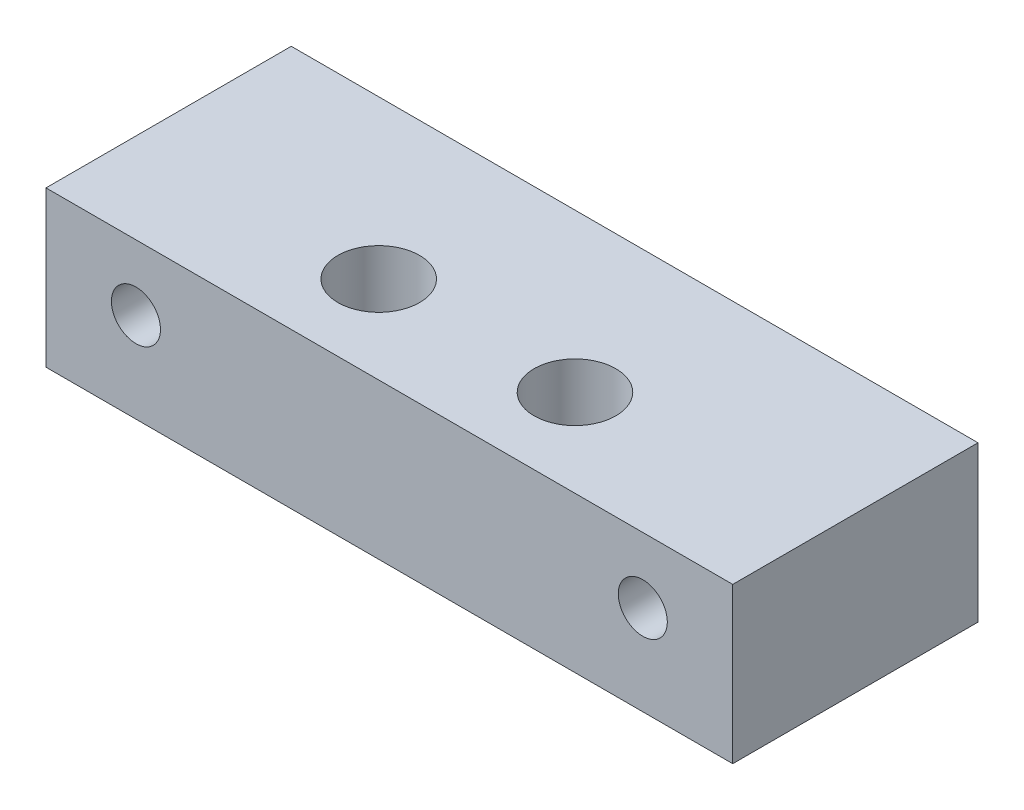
ISO-10303-21;
HEADER;
FILE_DESCRIPTION(('STEP AP214'),'2;1');
FILE_NAME('part.step','',(''),(''),'','','');
FILE_SCHEMA(('AUTOMOTIVE_DESIGN { 1 0 10303 214 1 1 1 1 }'));
ENDSEC;
DATA;
#1=APPLICATION_CONTEXT('core data for automotive mechanical design processes');
#2=APPLICATION_PROTOCOL_DEFINITION('international standard','automotive_design',2000,#1);
#3=PRODUCT_CONTEXT('',#1,'mechanical');
#4=PRODUCT('Part','Part','',(#3));
#5=PRODUCT_RELATED_PRODUCT_CATEGORY('part','',(#4));
#6=PRODUCT_DEFINITION_FORMATION('','',#4);
#7=PRODUCT_DEFINITION_CONTEXT('part definition',#1,'design');
#8=PRODUCT_DEFINITION('design','',#6,#7);
#9=PRODUCT_DEFINITION_SHAPE('','',#8);
#10=(LENGTH_UNIT() NAMED_UNIT(*) SI_UNIT(.MILLI.,.METRE.));
#11=(NAMED_UNIT(*) PLANE_ANGLE_UNIT() SI_UNIT($,.RADIAN.));
#12=(NAMED_UNIT(*) SI_UNIT($,.STERADIAN.) SOLID_ANGLE_UNIT());
#13=UNCERTAINTY_MEASURE_WITH_UNIT(LENGTH_MEASURE(1.E-05),#10,'distance_accuracy_value','');
#14=(GEOMETRIC_REPRESENTATION_CONTEXT(3) GLOBAL_UNCERTAINTY_ASSIGNED_CONTEXT((#13)) GLOBAL_UNIT_ASSIGNED_CONTEXT((#10,
#11,#12)) REPRESENTATION_CONTEXT('',''));
#15=CARTESIAN_POINT('',(0.,0.,0.));
#16=DIRECTION('',(0.,0.,1.));
#17=DIRECTION('',(1.,0.,0.));
#18=AXIS2_PLACEMENT_3D('',#15,#16,#17);
#19=CARTESIAN_POINT('',(-21.,9.5,7.49999999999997));
#20=DIRECTION('',(1.,0.,0.));
#21=DIRECTION('',(0.,0.,-1.));
#22=AXIS2_PLACEMENT_3D('',#19,#20,#21);
#23=PLANE('',#22);
#24=DIRECTION('',(0.,0.,1.));
#25=VECTOR('',#24,1.);
#26=CARTESIAN_POINT('',(-21.,0.,7.49999999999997));
#27=LINE('',#26,#25);
#28=CARTESIAN_POINT('',(-21.,0.,-7.50000000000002));
#29=VERTEX_POINT('',#28);
#30=CARTESIAN_POINT('',(-21.,0.,7.49999999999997));
#31=VERTEX_POINT('',#30);
#32=EDGE_CURVE('E97',#29,#31,#27,.T.);
#33=ORIENTED_EDGE('',*,*,#32,.T.);
#34=DIRECTION('',(0.,-1.,0.));
#35=VECTOR('',#34,1.);
#36=CARTESIAN_POINT('',(-21.,9.5,7.49999999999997));
#37=LINE('',#36,#35);
#38=CARTESIAN_POINT('',(-21.,9.5,7.49999999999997));
#39=VERTEX_POINT('',#38);
#40=EDGE_CURVE('E11',#39,#31,#37,.T.);
#41=ORIENTED_EDGE('',*,*,#40,.F.);
#42=DIRECTION('',(0.,0.,1.));
#43=VECTOR('',#42,1.);
#44=CARTESIAN_POINT('',(-21.,9.5,7.49999999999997));
#45=LINE('',#44,#43);
#46=CARTESIAN_POINT('',(-21.,9.5,-7.50000000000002));
#47=VERTEX_POINT('',#46);
#48=EDGE_CURVE('E85',#47,#39,#45,.T.);
#49=ORIENTED_EDGE('',*,*,#48,.F.);
#50=DIRECTION('',(0.,-1.,0.));
#51=VECTOR('',#50,1.);
#52=CARTESIAN_POINT('',(-21.,9.5,-7.50000000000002));
#53=LINE('',#52,#51);
#54=EDGE_CURVE('E93',#47,#29,#53,.T.);
#55=ORIENTED_EDGE('',*,*,#54,.T.);
#56=EDGE_LOOP('',(#33,#41,#49,#55));
#57=FACE_BOUND('',#56,.T.);
#58=ADVANCED_FACE('F34',(#57),#23,.F.);
#59=CARTESIAN_POINT('',(21.,9.5,7.49999999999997));
#60=DIRECTION('',(0.,0.,-1.));
#61=DIRECTION('',(-1.,0.,0.));
#62=AXIS2_PLACEMENT_3D('',#59,#60,#61);
#63=PLANE('',#62);
#64=CARTESIAN_POINT('',(15.5,5.5,7.49999999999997));
#65=DIRECTION('',(0.,0.,1.));
#66=DIRECTION('',(1.,0.,0.));
#67=AXIS2_PLACEMENT_3D('',#64,#65,#66);
#68=CIRCLE('',#67,1.5);
#69=CARTESIAN_POINT('',(17.,5.5,7.49999999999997));
#70=VERTEX_POINT('',#69);
#71=EDGE_CURVE('E129',#70,#70,#68,.T.);
#72=ORIENTED_EDGE('',*,*,#71,.F.);
#73=EDGE_LOOP('',(#72));
#74=FACE_BOUND('',#73,.T.);
#75=CARTESIAN_POINT('',(-15.5,5.5,7.49999999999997));
#76=DIRECTION('',(0.,0.,1.));
#77=DIRECTION('',(1.,0.,0.));
#78=AXIS2_PLACEMENT_3D('',#75,#76,#77);
#79=CIRCLE('',#78,1.5);
#80=CARTESIAN_POINT('',(-14.,5.5,7.49999999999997));
#81=VERTEX_POINT('',#80);
#82=EDGE_CURVE('E123',#81,#81,#79,.T.);
#83=ORIENTED_EDGE('',*,*,#82,.F.);
#84=EDGE_LOOP('',(#83));
#85=FACE_BOUND('',#84,.T.);
#86=DIRECTION('',(1.,0.,0.));
#87=VECTOR('',#86,1.);
#88=CARTESIAN_POINT('',(21.,0.,7.49999999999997));
#89=LINE('',#88,#87);
#90=CARTESIAN_POINT('',(21.,0.,7.49999999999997));
#91=VERTEX_POINT('',#90);
#92=EDGE_CURVE('E89',#31,#91,#89,.T.);
#93=ORIENTED_EDGE('',*,*,#92,.T.);
#94=DIRECTION('',(0.,-1.,0.));
#95=VECTOR('',#94,1.);
#96=CARTESIAN_POINT('',(21.,9.5,7.49999999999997));
#97=LINE('',#96,#95);
#98=CARTESIAN_POINT('',(21.,9.5,7.49999999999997));
#99=VERTEX_POINT('',#98);
#100=EDGE_CURVE('E42',#99,#91,#97,.T.);
#101=ORIENTED_EDGE('',*,*,#100,.F.);
#102=DIRECTION('',(1.,0.,0.));
#103=VECTOR('',#102,1.);
#104=CARTESIAN_POINT('',(21.,9.5,7.49999999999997));
#105=LINE('',#104,#103);
#106=EDGE_CURVE('E80',#39,#99,#105,.T.);
#107=ORIENTED_EDGE('',*,*,#106,.F.);
#108=ORIENTED_EDGE('',*,*,#40,.T.);
#109=EDGE_LOOP('',(#93,#101,#107,#108));
#110=FACE_BOUND('',#109,.T.);
#111=ADVANCED_FACE('F88',(#74,#85,#110),#63,.F.);
#112=CARTESIAN_POINT('',(21.,9.5,7.49999999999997));
#113=DIRECTION('',(-1.,0.,0.));
#114=DIRECTION('',(0.,0.,1.));
#115=AXIS2_PLACEMENT_3D('',#112,#113,#114);
#116=PLANE('',#115);
#117=DIRECTION('',(0.,0.,-1.));
#118=VECTOR('',#117,1.);
#119=CARTESIAN_POINT('',(21.,0.,7.49999999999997));
#120=LINE('',#119,#118);
#121=CARTESIAN_POINT('',(21.,0.,-7.50000000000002));
#122=VERTEX_POINT('',#121);
#123=EDGE_CURVE('E67',#91,#122,#120,.T.);
#124=ORIENTED_EDGE('',*,*,#123,.T.);
#125=DIRECTION('',(0.,-1.,0.));
#126=VECTOR('',#125,1.);
#127=CARTESIAN_POINT('',(21.,9.5,-7.50000000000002));
#128=LINE('',#127,#126);
#129=CARTESIAN_POINT('',(21.,9.5,-7.50000000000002));
#130=VERTEX_POINT('',#129);
#131=EDGE_CURVE('E90',#130,#122,#128,.T.);
#132=ORIENTED_EDGE('',*,*,#131,.F.);
#133=DIRECTION('',(0.,0.,-1.));
#134=VECTOR('',#133,1.);
#135=CARTESIAN_POINT('',(21.,9.5,7.49999999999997));
#136=LINE('',#135,#134);
#137=EDGE_CURVE('E83',#99,#130,#136,.T.);
#138=ORIENTED_EDGE('',*,*,#137,.F.);
#139=ORIENTED_EDGE('',*,*,#100,.T.);
#140=EDGE_LOOP('',(#124,#132,#138,#139));
#141=FACE_BOUND('',#140,.T.);
#142=ADVANCED_FACE('F91',(#141),#116,.F.);
#143=CARTESIAN_POINT('',(21.,9.5,-7.50000000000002));
#144=DIRECTION('',(0.,0.,1.));
#145=DIRECTION('',(1.,0.,0.));
#146=AXIS2_PLACEMENT_3D('',#143,#144,#145);
#147=PLANE('',#146);
#148=CARTESIAN_POINT('',(15.5,5.5,-7.50000000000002));
#149=DIRECTION('',(0.,0.,1.));
#150=DIRECTION('',(1.,0.,0.));
#151=AXIS2_PLACEMENT_3D('',#148,#149,#150);
#152=CIRCLE('',#151,1.5);
#153=CARTESIAN_POINT('',(17.,5.5,-7.50000000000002));
#154=VERTEX_POINT('',#153);
#155=EDGE_CURVE('E126',#154,#154,#152,.T.);
#156=ORIENTED_EDGE('',*,*,#155,.T.);
#157=EDGE_LOOP('',(#156));
#158=FACE_BOUND('',#157,.T.);
#159=CARTESIAN_POINT('',(-15.5,5.5,-7.50000000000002));
#160=DIRECTION('',(0.,0.,1.));
#161=DIRECTION('',(1.,0.,0.));
#162=AXIS2_PLACEMENT_3D('',#159,#160,#161);
#163=CIRCLE('',#162,1.5);
#164=CARTESIAN_POINT('',(-14.,5.5,-7.50000000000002));
#165=VERTEX_POINT('',#164);
#166=EDGE_CURVE('E120',#165,#165,#163,.T.);
#167=ORIENTED_EDGE('',*,*,#166,.T.);
#168=EDGE_LOOP('',(#167));
#169=FACE_BOUND('',#168,.T.);
#170=DIRECTION('',(-1.,0.,0.));
#171=VECTOR('',#170,1.);
#172=CARTESIAN_POINT('',(21.,0.,-7.50000000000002));
#173=LINE('',#172,#171);
#174=EDGE_CURVE('E73',#122,#29,#173,.T.);
#175=ORIENTED_EDGE('',*,*,#174,.T.);
#176=ORIENTED_EDGE('',*,*,#54,.F.);
#177=DIRECTION('',(-1.,0.,0.));
#178=VECTOR('',#177,1.);
#179=CARTESIAN_POINT('',(21.,9.5,-7.50000000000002));
#180=LINE('',#179,#178);
#181=EDGE_CURVE('E50',#130,#47,#180,.T.);
#182=ORIENTED_EDGE('',*,*,#181,.F.);
#183=ORIENTED_EDGE('',*,*,#131,.T.);
#184=EDGE_LOOP('',(#175,#176,#182,#183));
#185=FACE_BOUND('',#184,.T.);
#186=ADVANCED_FACE('F105',(#158,#169,#185),#147,.F.);
#187=CARTESIAN_POINT('',(0.,9.5,0.));
#188=DIRECTION('',(0.,1.,0.));
#189=DIRECTION('',(0.,0.,1.));
#190=AXIS2_PLACEMENT_3D('',#187,#188,#189);
#191=PLANE('',#190);
#192=CARTESIAN_POINT('',(6.,9.5,2.14999999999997));
#193=DIRECTION('',(0.,1.,0.));
#194=DIRECTION('',(0.,0.,1.));
#195=AXIS2_PLACEMENT_3D('',#192,#193,#194);
#196=CIRCLE('',#195,2.5);
#197=CARTESIAN_POINT('',(6.,9.5,4.64999999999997));
#198=VERTEX_POINT('',#197);
#199=EDGE_CURVE('E117',#198,#198,#196,.T.);
#200=ORIENTED_EDGE('',*,*,#199,.F.);
#201=EDGE_LOOP('',(#200));
#202=FACE_BOUND('',#201,.T.);
#203=CARTESIAN_POINT('',(-6.,9.5,2.14999999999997));
#204=DIRECTION('',(0.,1.,0.));
#205=DIRECTION('',(0.,0.,1.));
#206=AXIS2_PLACEMENT_3D('',#203,#204,#205);
#207=CIRCLE('',#206,2.5);
#208=CARTESIAN_POINT('',(-6.,9.5,4.64999999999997));
#209=VERTEX_POINT('',#208);
#210=EDGE_CURVE('E111',#209,#209,#207,.T.);
#211=ORIENTED_EDGE('',*,*,#210,.F.);
#212=EDGE_LOOP('',(#211));
#213=FACE_BOUND('',#212,.T.);
#214=ORIENTED_EDGE('',*,*,#48,.T.);
#215=ORIENTED_EDGE('',*,*,#106,.T.);
#216=ORIENTED_EDGE('',*,*,#137,.T.);
#217=ORIENTED_EDGE('',*,*,#181,.T.);
#218=EDGE_LOOP('',(#214,#215,#216,#217));
#219=FACE_BOUND('',#218,.T.);
#220=ADVANCED_FACE('F81',(#202,#213,#219),#191,.T.);
#221=CARTESIAN_POINT('',(0.,0.,0.));
#222=DIRECTION('',(0.,1.,0.));
#223=DIRECTION('',(0.,0.,1.));
#224=AXIS2_PLACEMENT_3D('',#221,#222,#223);
#225=PLANE('',#224);
#226=CARTESIAN_POINT('',(6.,0.,2.14999999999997));
#227=DIRECTION('',(0.,1.,0.));
#228=DIRECTION('',(0.,0.,1.));
#229=AXIS2_PLACEMENT_3D('',#226,#227,#228);
#230=CIRCLE('',#229,2.5);
#231=CARTESIAN_POINT('',(6.,0.,4.64999999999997));
#232=VERTEX_POINT('',#231);
#233=EDGE_CURVE('E114',#232,#232,#230,.T.);
#234=ORIENTED_EDGE('',*,*,#233,.T.);
#235=EDGE_LOOP('',(#234));
#236=FACE_BOUND('',#235,.T.);
#237=CARTESIAN_POINT('',(-6.,0.,2.14999999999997));
#238=DIRECTION('',(0.,1.,0.));
#239=DIRECTION('',(0.,0.,1.));
#240=AXIS2_PLACEMENT_3D('',#237,#238,#239);
#241=CIRCLE('',#240,2.5);
#242=CARTESIAN_POINT('',(-6.,0.,4.64999999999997));
#243=VERTEX_POINT('',#242);
#244=EDGE_CURVE('E100',#243,#243,#241,.T.);
#245=ORIENTED_EDGE('',*,*,#244,.T.);
#246=EDGE_LOOP('',(#245));
#247=FACE_BOUND('',#246,.T.);
#248=ORIENTED_EDGE('',*,*,#32,.F.);
#249=ORIENTED_EDGE('',*,*,#174,.F.);
#250=ORIENTED_EDGE('',*,*,#123,.F.);
#251=ORIENTED_EDGE('',*,*,#92,.F.);
#252=EDGE_LOOP('',(#248,#249,#250,#251));
#253=FACE_BOUND('',#252,.T.);
#254=ADVANCED_FACE('F108',(#236,#247,#253),#225,.F.);
#255=CARTESIAN_POINT('',(-6.,0.,2.14999999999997));
#256=DIRECTION('',(0.,1.,0.));
#257=DIRECTION('',(0.,0.,1.));
#258=AXIS2_PLACEMENT_3D('',#255,#256,#257);
#259=CYLINDRICAL_SURFACE('',#258,2.5);
#260=ORIENTED_EDGE('',*,*,#244,.F.);
#261=EDGE_LOOP('',(#260));
#262=FACE_BOUND('',#261,.T.);
#263=ORIENTED_EDGE('',*,*,#210,.T.);
#264=EDGE_LOOP('',(#263));
#265=FACE_BOUND('',#264,.T.);
#266=ADVANCED_FACE('F155',(#262,#265),#259,.F.);
#267=CARTESIAN_POINT('',(6.,0.,2.14999999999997));
#268=DIRECTION('',(0.,1.,0.));
#269=DIRECTION('',(0.,0.,1.));
#270=AXIS2_PLACEMENT_3D('',#267,#268,#269);
#271=CYLINDRICAL_SURFACE('',#270,2.5);
#272=ORIENTED_EDGE('',*,*,#233,.F.);
#273=EDGE_LOOP('',(#272));
#274=FACE_BOUND('',#273,.T.);
#275=ORIENTED_EDGE('',*,*,#199,.T.);
#276=EDGE_LOOP('',(#275));
#277=FACE_BOUND('',#276,.T.);
#278=ADVANCED_FACE('F149',(#274,#277),#271,.F.);
#279=CARTESIAN_POINT('',(-15.5,5.5,-7.50000000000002));
#280=DIRECTION('',(0.,0.,1.));
#281=DIRECTION('',(1.,0.,0.));
#282=AXIS2_PLACEMENT_3D('',#279,#280,#281);
#283=CYLINDRICAL_SURFACE('',#282,1.5);
#284=ORIENTED_EDGE('',*,*,#166,.F.);
#285=EDGE_LOOP('',(#284));
#286=FACE_BOUND('',#285,.T.);
#287=ORIENTED_EDGE('',*,*,#82,.T.);
#288=EDGE_LOOP('',(#287));
#289=FACE_BOUND('',#288,.T.);
#290=ADVANCED_FACE('F140',(#286,#289),#283,.F.);
#291=CARTESIAN_POINT('',(15.5,5.5,-7.50000000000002));
#292=DIRECTION('',(0.,0.,1.));
#293=DIRECTION('',(1.,0.,0.));
#294=AXIS2_PLACEMENT_3D('',#291,#292,#293);
#295=CYLINDRICAL_SURFACE('',#294,1.5);
#296=ORIENTED_EDGE('',*,*,#155,.F.);
#297=EDGE_LOOP('',(#296));
#298=FACE_BOUND('',#297,.T.);
#299=ORIENTED_EDGE('',*,*,#71,.T.);
#300=EDGE_LOOP('',(#299));
#301=FACE_BOUND('',#300,.T.);
#302=ADVANCED_FACE('F137',(#298,#301),#295,.F.);
#303=CLOSED_SHELL('',(#58,#111,#142,#186,#220,#254,#266,#278,#290,#302));
#304=MANIFOLD_SOLID_BREP('B2',#303);
#305=ADVANCED_BREP_SHAPE_REPRESENTATION('',(#18,#304),#14);
#306=SHAPE_DEFINITION_REPRESENTATION(#9,#305);
ENDSEC;
END-ISO-10303-21;
